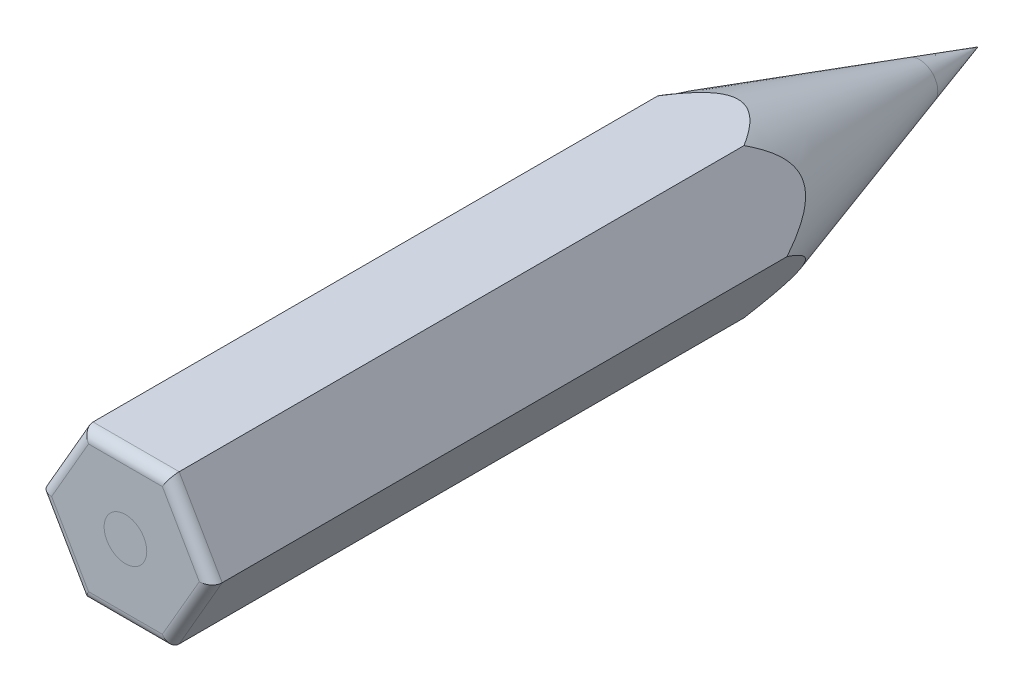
from build123d import *

# Parameters (mm, degrees)
BOSS_EXTRU_1_DEPTH = 40
CONG_1_R           = 0.5


with BuildPart() as part:
    # Esquisse1 → Boss.-Extru.1 (new body)
    with BuildSketch(Plane.XY):
        Polygon((4.041451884, 0), (2.020725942, 3.5), (-2.020725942, 3.5), (-4.041451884, 0), (-2.020725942, -3.5), (2.020725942, -3.5), align=None)
    extrude(amount=BOSS_EXTRU_1_DEPTH)

    # Enl_v. mat.-Surface1: cut with a surface, the side behind it stays
    # Surface-R_volution1: a surface, the sketch's curves turned about an axis
    with BuildLine(Plane(origin=(0, 0, 0), x_dir=(0, 0, 1), z_dir=(-0.8660254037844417, 0.49999999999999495, 0)), mode=Mode.PRIVATE) as surface_r_volution1_1_path:
        Line((0, 0), (13, 4.041451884))
    surface_r_volution1_1 = Shell.revolve(surface_r_volution1_1_path.wire(), 360, Axis((0, 0, -6.49703504), (0, 0, 1)))
    split(bisect_by=surface_r_volution1_1, keep=Keep.BOTTOM)

    # Cong_1
    cong_1_edges = [part.edges().sort_by_distance(p)[0] for p in [
        (0, 3.5, 40),
        (-3.031088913, 1.75, 40),
        (-3.031088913, -1.75, 40),
        (0, -3.5, 40),
        (3.031088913, -1.75, 40),
        (3.031088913, 1.75, 40),
    ]]
    fillet(cong_1_edges, radius=CONG_1_R)


solid = part.part
